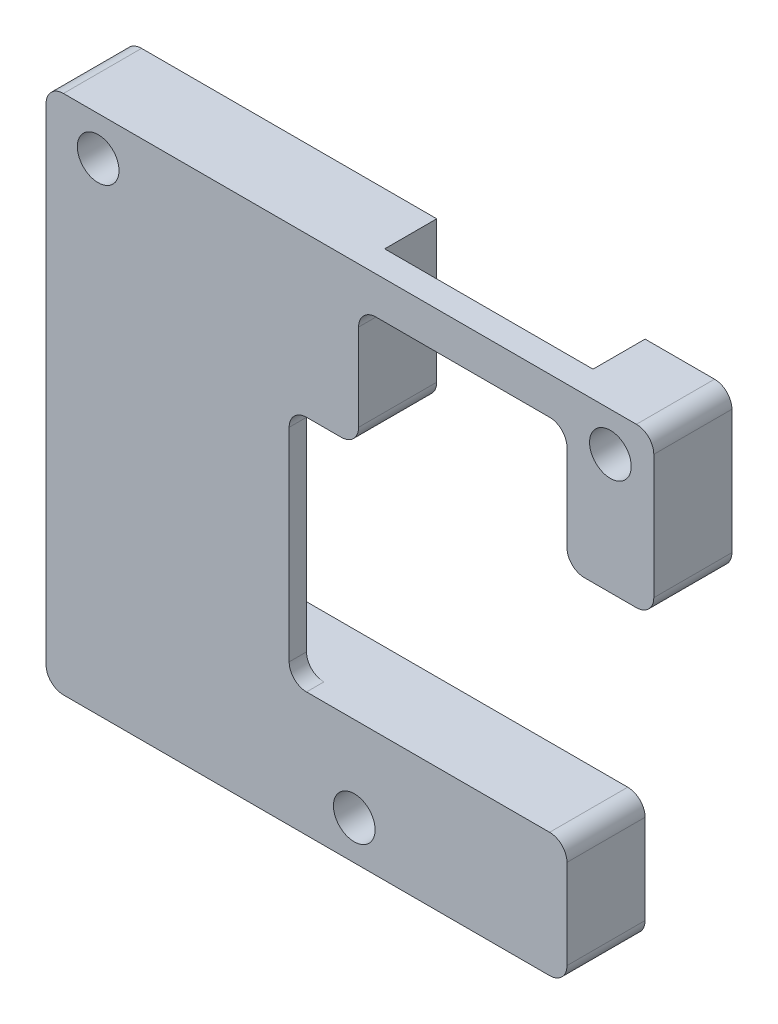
ISO-10303-21;
HEADER;
FILE_DESCRIPTION(('STEP AP214'),'2;1');
FILE_NAME('part.step','',(''),(''),'','','');
FILE_SCHEMA(('AUTOMOTIVE_DESIGN { 1 0 10303 214 1 1 1 1 }'));
ENDSEC;
DATA;
#1=APPLICATION_CONTEXT('core data for automotive mechanical design processes');
#2=APPLICATION_PROTOCOL_DEFINITION('international standard','automotive_design',2000,#1);
#3=PRODUCT_CONTEXT('',#1,'mechanical');
#4=PRODUCT('Part','Part','',(#3));
#5=PRODUCT_RELATED_PRODUCT_CATEGORY('part','',(#4));
#6=PRODUCT_DEFINITION_FORMATION('','',#4);
#7=PRODUCT_DEFINITION_CONTEXT('part definition',#1,'design');
#8=PRODUCT_DEFINITION('design','',#6,#7);
#9=PRODUCT_DEFINITION_SHAPE('','',#8);
#10=(LENGTH_UNIT() NAMED_UNIT(*) SI_UNIT(.MILLI.,.METRE.));
#11=(NAMED_UNIT(*) PLANE_ANGLE_UNIT() SI_UNIT($,.RADIAN.));
#12=(NAMED_UNIT(*) SI_UNIT($,.STERADIAN.) SOLID_ANGLE_UNIT());
#13=UNCERTAINTY_MEASURE_WITH_UNIT(LENGTH_MEASURE(1.E-05),#10,'distance_accuracy_value','');
#14=(GEOMETRIC_REPRESENTATION_CONTEXT(3) GLOBAL_UNCERTAINTY_ASSIGNED_CONTEXT((#13)) GLOBAL_UNIT_ASSIGNED_CONTEXT((#10,
#11,#12)) REPRESENTATION_CONTEXT('',''));
#15=CARTESIAN_POINT('',(0.,0.,0.));
#16=DIRECTION('',(0.,0.,1.));
#17=DIRECTION('',(1.,0.,0.));
#18=AXIS2_PLACEMENT_3D('',#15,#16,#17);
#19=CARTESIAN_POINT('',(0.,0.,0.));
#20=DIRECTION('',(0.,0.,1.));
#21=DIRECTION('',(1.,0.,0.));
#22=AXIS2_PLACEMENT_3D('',#19,#20,#21);
#23=PLANE('',#22);
#24=CARTESIAN_POINT('',(7.39999999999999,12.75,0.));
#25=DIRECTION('',(0.,0.,1.));
#26=DIRECTION('',(1.,0.,0.));
#27=AXIS2_PLACEMENT_3D('',#24,#25,#26);
#28=CIRCLE('',#27,1.2);
#29=CARTESIAN_POINT('',(8.59999999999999,12.75,0.));
#30=VERTEX_POINT('',#29);
#31=EDGE_CURVE('E390',#30,#30,#28,.T.);
#32=ORIENTED_EDGE('',*,*,#31,.T.);
#33=EDGE_LOOP('',(#32));
#34=FACE_BOUND('',#33,.T.);
#35=DIRECTION('',(0.,1.,0.));
#36=VECTOR('',#35,1.);
#37=CARTESIAN_POINT('',(22.4,12.85,0.));
#38=LINE('',#37,#36);
#39=CARTESIAN_POINT('',(22.4,6.85,0.));
#40=VERTEX_POINT('',#39);
#41=CARTESIAN_POINT('',(22.4,15.,0.));
#42=VERTEX_POINT('',#41);
#43=EDGE_CURVE('E221',#40,#42,#38,.T.);
#44=ORIENTED_EDGE('',*,*,#43,.F.);
#45=CARTESIAN_POINT('',(21.4,6.85,0.));
#46=DIRECTION('',(0.,0.,1.));
#47=DIRECTION('',(1.,0.,0.));
#48=AXIS2_PLACEMENT_3D('',#45,#46,#47);
#49=CIRCLE('',#48,1.);
#50=CARTESIAN_POINT('',(21.4,5.85,0.));
#51=VERTEX_POINT('',#50);
#52=EDGE_CURVE('E287',#40,#51,#49,.F.);
#53=ORIENTED_EDGE('',*,*,#52,.T.);
#54=DIRECTION('',(1.,0.,0.));
#55=VECTOR('',#54,1.);
#56=CARTESIAN_POINT('',(4.39999999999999,5.85,0.));
#57=LINE('',#56,#55);
#58=CARTESIAN_POINT('',(4.39999999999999,5.85,0.));
#59=VERTEX_POINT('',#58);
#60=EDGE_CURVE('E232',#59,#51,#57,.T.);
#61=ORIENTED_EDGE('',*,*,#60,.F.);
#62=DIRECTION('',(0.,-1.,0.));
#63=VECTOR('',#62,1.);
#64=CARTESIAN_POINT('',(4.39999999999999,15.,0.));
#65=LINE('',#64,#63);
#66=CARTESIAN_POINT('',(4.39999999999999,14.,0.));
#67=VERTEX_POINT('',#66);
#68=EDGE_CURVE('E432',#67,#59,#65,.T.);
#69=ORIENTED_EDGE('',*,*,#68,.F.);
#70=CARTESIAN_POINT('',(5.39999999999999,14.,0.));
#71=DIRECTION('',(0.,0.,1.));
#72=DIRECTION('',(1.,0.,0.));
#73=AXIS2_PLACEMENT_3D('',#70,#71,#72);
#74=CIRCLE('',#73,1.);
#75=CARTESIAN_POINT('',(5.39999999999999,15.,0.));
#76=VERTEX_POINT('',#75);
#77=EDGE_CURVE('E246',#67,#76,#74,.F.);
#78=ORIENTED_EDGE('',*,*,#77,.T.);
#79=DIRECTION('',(-1.,0.,0.));
#80=VECTOR('',#79,1.);
#81=CARTESIAN_POINT('',(4.39999999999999,15.,0.));
#82=LINE('',#81,#80);
#83=EDGE_CURVE('E237',#42,#76,#82,.T.);
#84=ORIENTED_EDGE('',*,*,#83,.F.);
#85=EDGE_LOOP('',(#44,#53,#61,#69,#78,#84));
#86=FACE_BOUND('',#85,.T.);
#87=ADVANCED_FACE('F34',(#34,#86),#23,.F.);
#88=CARTESIAN_POINT('',(18.4,15.,4.5));
#89=DIRECTION('',(-1.,0.,0.));
#90=DIRECTION('',(0.,-1.,0.));
#91=AXIS2_PLACEMENT_3D('',#88,#89,#90);
#92=PLANE('',#91);
#93=DIRECTION('',(0.,1.,0.));
#94=VECTOR('',#93,1.);
#95=CARTESIAN_POINT('',(18.4,15.,4.5));
#96=LINE('',#95,#94);
#97=CARTESIAN_POINT('',(18.4,-6.85,4.5));
#98=VERTEX_POINT('',#97);
#99=CARTESIAN_POINT('',(18.4,4.85,4.5));
#100=VERTEX_POINT('',#99);
#101=EDGE_CURVE('E384',#98,#100,#96,.T.);
#102=ORIENTED_EDGE('',*,*,#101,.F.);
#103=DIRECTION('',(0.,0.,-1.));
#104=VECTOR('',#103,1.);
#105=CARTESIAN_POINT('',(18.4,-6.85,3.5));
#106=LINE('',#105,#104);
#107=CARTESIAN_POINT('',(18.4,-6.85,3.5));
#108=VERTEX_POINT('',#107);
#109=EDGE_CURVE('E273',#98,#108,#106,.T.);
#110=ORIENTED_EDGE('',*,*,#109,.T.);
#111=DIRECTION('',(0.,1.,0.));
#112=VECTOR('',#111,1.);
#113=CARTESIAN_POINT('',(18.4,15.,3.5));
#114=LINE('',#113,#112);
#115=CARTESIAN_POINT('',(18.4,4.85,3.5));
#116=VERTEX_POINT('',#115);
#117=EDGE_CURVE('E363',#108,#116,#114,.T.);
#118=ORIENTED_EDGE('',*,*,#117,.T.);
#119=DIRECTION('',(0.,0.,-1.));
#120=VECTOR('',#119,1.);
#121=CARTESIAN_POINT('',(18.4,4.85,4.5));
#122=LINE('',#121,#120);
#123=EDGE_CURVE('E271',#116,#100,#122,.F.);
#124=ORIENTED_EDGE('',*,*,#123,.T.);
#125=EDGE_LOOP('',(#102,#110,#118,#124));
#126=FACE_BOUND('',#125,.T.);
#127=ADVANCED_FACE('F370',(#126),#92,.F.);
#128=CARTESIAN_POINT('',(0.,0.,3.5));
#129=DIRECTION('',(0.,0.,1.));
#130=DIRECTION('',(1.,0.,0.));
#131=AXIS2_PLACEMENT_3D('',#128,#129,#130);
#132=PLANE('',#131);
#133=DIRECTION('',(-1.,0.,0.));
#134=VECTOR('',#133,1.);
#135=CARTESIAN_POINT('',(4.4,-7.85,3.5));
#136=LINE('',#135,#134);
#137=CARTESIAN_POINT('',(19.4,-7.85,3.5));
#138=VERTEX_POINT('',#137);
#139=CARTESIAN_POINT('',(4.4,-7.85,3.5));
#140=VERTEX_POINT('',#139);
#141=EDGE_CURVE('E408',#138,#140,#136,.T.);
#142=ORIENTED_EDGE('',*,*,#141,.T.);
#143=DIRECTION('',(0.,-1.,0.));
#144=VECTOR('',#143,1.);
#145=CARTESIAN_POINT('',(4.39999999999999,15.,3.5));
#146=LINE('',#145,#144);
#147=CARTESIAN_POINT('',(4.39999999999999,5.85,3.5));
#148=VERTEX_POINT('',#147);
#149=EDGE_CURVE('E374',#148,#140,#146,.T.);
#150=ORIENTED_EDGE('',*,*,#149,.F.);
#151=DIRECTION('',(1.,0.,0.));
#152=VECTOR('',#151,1.);
#153=CARTESIAN_POINT('',(4.39999999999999,5.85,3.5));
#154=LINE('',#153,#152);
#155=CARTESIAN_POINT('',(19.4,5.85,3.5));
#156=VERTEX_POINT('',#155);
#157=EDGE_CURVE('E250',#148,#156,#154,.T.);
#158=ORIENTED_EDGE('',*,*,#157,.T.);
#159=CARTESIAN_POINT('',(19.4,4.85,3.5));
#160=DIRECTION('',(0.,0.,1.));
#161=DIRECTION('',(1.,0.,0.));
#162=AXIS2_PLACEMENT_3D('',#159,#160,#161);
#163=CIRCLE('',#162,1.);
#164=EDGE_CURVE('E42',#156,#116,#163,.T.);
#165=ORIENTED_EDGE('',*,*,#164,.T.);
#166=ORIENTED_EDGE('',*,*,#117,.F.);
#167=CARTESIAN_POINT('',(19.4,-6.85,3.5));
#168=DIRECTION('',(0.,0.,1.));
#169=DIRECTION('',(1.,0.,0.));
#170=AXIS2_PLACEMENT_3D('',#167,#168,#169);
#171=CIRCLE('',#170,1.);
#172=EDGE_CURVE('E353',#108,#138,#171,.T.);
#173=ORIENTED_EDGE('',*,*,#172,.T.);
#174=EDGE_LOOP('',(#142,#150,#158,#165,#166,#173));
#175=FACE_BOUND('',#174,.T.);
#176=ADVANCED_FACE('F362',(#175),#132,.F.);
#177=CARTESIAN_POINT('',(4.39999999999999,15.,3.5));
#178=DIRECTION('',(1.,0.,0.));
#179=DIRECTION('',(0.,1.,0.));
#180=AXIS2_PLACEMENT_3D('',#177,#178,#179);
#181=PLANE('',#180);
#182=DIRECTION('',(0.,-1.,0.));
#183=VECTOR('',#182,1.);
#184=CARTESIAN_POINT('',(4.39999999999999,15.,4.5));
#185=LINE('',#184,#183);
#186=CARTESIAN_POINT('',(4.39999999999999,14.,4.5));
#187=VERTEX_POINT('',#186);
#188=CARTESIAN_POINT('',(4.39999999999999,-14.,4.5));
#189=VERTEX_POINT('',#188);
#190=EDGE_CURVE('E373',#187,#189,#185,.T.);
#191=ORIENTED_EDGE('',*,*,#190,.F.);
#192=DIRECTION('',(0.,0.,-1.));
#193=VECTOR('',#192,1.);
#194=CARTESIAN_POINT('',(4.39999999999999,14.,3.5));
#195=LINE('',#194,#193);
#196=EDGE_CURVE('E307',#187,#67,#195,.T.);
#197=ORIENTED_EDGE('',*,*,#196,.T.);
#198=ORIENTED_EDGE('',*,*,#68,.T.);
#199=DIRECTION('',(0.,0.,-1.));
#200=VECTOR('',#199,1.);
#201=CARTESIAN_POINT('',(4.39999999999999,5.85,3.5));
#202=LINE('',#201,#200);
#203=EDGE_CURVE('E255',#148,#59,#202,.T.);
#204=ORIENTED_EDGE('',*,*,#203,.F.);
#205=ORIENTED_EDGE('',*,*,#149,.T.);
#206=DIRECTION('',(0.,0.,-1.));
#207=VECTOR('',#206,1.);
#208=CARTESIAN_POINT('',(4.4,-7.85,3.5));
#209=LINE('',#208,#207);
#210=CARTESIAN_POINT('',(4.4,-7.85,0.));
#211=VERTEX_POINT('',#210);
#212=EDGE_CURVE('E410',#140,#211,#209,.T.);
#213=ORIENTED_EDGE('',*,*,#212,.T.);
#214=DIRECTION('',(0.,-1.,0.));
#215=VECTOR('',#214,1.);
#216=CARTESIAN_POINT('',(4.39999999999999,-15.,0.));
#217=LINE('',#216,#215);
#218=CARTESIAN_POINT('',(4.39999999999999,-14.,0.));
#219=VERTEX_POINT('',#218);
#220=EDGE_CURVE('E403',#211,#219,#217,.T.);
#221=ORIENTED_EDGE('',*,*,#220,.T.);
#222=DIRECTION('',(0.,0.,-1.));
#223=VECTOR('',#222,1.);
#224=CARTESIAN_POINT('',(4.4,-14.,3.5));
#225=LINE('',#224,#223);
#226=EDGE_CURVE('E305',#219,#189,#225,.F.);
#227=ORIENTED_EDGE('',*,*,#226,.T.);
#228=EDGE_LOOP('',(#191,#197,#198,#204,#205,#213,#221,#227));
#229=FACE_BOUND('',#228,.T.);
#230=ADVANCED_FACE('F554',(#229),#181,.F.);
#231=CARTESIAN_POINT('',(4.39999999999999,5.85,3.5));
#232=DIRECTION('',(0.,1.,0.));
#233=DIRECTION('',(0.,0.,1.));
#234=AXIS2_PLACEMENT_3D('',#231,#232,#233);
#235=PLANE('',#234);
#236=DIRECTION('',(1.,0.,0.));
#237=VECTOR('',#236,1.);
#238=CARTESIAN_POINT('',(18.4,5.85,4.5));
#239=LINE('',#238,#237);
#240=CARTESIAN_POINT('',(19.4,5.85,4.5));
#241=VERTEX_POINT('',#240);
#242=CARTESIAN_POINT('',(21.4,5.85,4.5));
#243=VERTEX_POINT('',#242);
#244=EDGE_CURVE('E382',#241,#243,#239,.T.);
#245=ORIENTED_EDGE('',*,*,#244,.F.);
#246=DIRECTION('',(0.,0.,-1.));
#247=VECTOR('',#246,1.);
#248=CARTESIAN_POINT('',(19.4,5.85,3.5));
#249=LINE('',#248,#247);
#250=EDGE_CURVE('E283',#241,#156,#249,.T.);
#251=ORIENTED_EDGE('',*,*,#250,.T.);
#252=ORIENTED_EDGE('',*,*,#157,.F.);
#253=ORIENTED_EDGE('',*,*,#203,.T.);
#254=ORIENTED_EDGE('',*,*,#60,.T.);
#255=DIRECTION('',(0.,0.,-1.));
#256=VECTOR('',#255,1.);
#257=CARTESIAN_POINT('',(21.4,5.85,3.5));
#258=LINE('',#257,#256);
#259=EDGE_CURVE('E281',#51,#243,#258,.F.);
#260=ORIENTED_EDGE('',*,*,#259,.T.);
#261=EDGE_LOOP('',(#245,#251,#252,#253,#254,#260));
#262=FACE_BOUND('',#261,.T.);
#263=ADVANCED_FACE('F386',(#262),#235,.F.);
#264=CARTESIAN_POINT('',(22.4,12.85,3.5));
#265=DIRECTION('',(-1.,0.,0.));
#266=DIRECTION('',(0.,-1.,0.));
#267=AXIS2_PLACEMENT_3D('',#264,#265,#266);
#268=PLANE('',#267);
#269=DIRECTION('',(0.,-1.,0.));
#270=VECTOR('',#269,1.);
#271=CARTESIAN_POINT('',(22.4,15.,3.));
#272=LINE('',#271,#270);
#273=CARTESIAN_POINT('',(22.4,15.,3.));
#274=VERTEX_POINT('',#273);
#275=CARTESIAN_POINT('',(22.4,11.85,3.));
#276=VERTEX_POINT('',#275);
#277=EDGE_CURVE('E490',#274,#276,#272,.T.);
#278=ORIENTED_EDGE('',*,*,#277,.T.);
#279=DIRECTION('',(0.,0.,-1.));
#280=VECTOR('',#279,1.);
#281=CARTESIAN_POINT('',(22.4,11.85,4.5));
#282=LINE('',#281,#280);
#283=CARTESIAN_POINT('',(22.4,11.85,4.5));
#284=VERTEX_POINT('',#283);
#285=EDGE_CURVE('E269',#276,#284,#282,.F.);
#286=ORIENTED_EDGE('',*,*,#285,.T.);
#287=DIRECTION('',(0.,1.,0.));
#288=VECTOR('',#287,1.);
#289=CARTESIAN_POINT('',(22.4,5.85,4.5));
#290=LINE('',#289,#288);
#291=CARTESIAN_POINT('',(22.4,6.85,4.5));
#292=VERTEX_POINT('',#291);
#293=EDGE_CURVE('E389',#292,#284,#290,.T.);
#294=ORIENTED_EDGE('',*,*,#293,.F.);
#295=DIRECTION('',(0.,0.,-1.));
#296=VECTOR('',#295,1.);
#297=CARTESIAN_POINT('',(22.4,6.85,3.5));
#298=LINE('',#297,#296);
#299=EDGE_CURVE('E228',#292,#40,#298,.T.);
#300=ORIENTED_EDGE('',*,*,#299,.T.);
#301=ORIENTED_EDGE('',*,*,#43,.T.);
#302=DIRECTION('',(0.,0.,-1.));
#303=VECTOR('',#302,1.);
#304=CARTESIAN_POINT('',(22.4,15.,0.));
#305=LINE('',#304,#303);
#306=EDGE_CURVE('E224',#274,#42,#305,.T.);
#307=ORIENTED_EDGE('',*,*,#306,.F.);
#308=EDGE_LOOP('',(#278,#286,#294,#300,#301,#307));
#309=FACE_BOUND('',#308,.T.);
#310=ADVANCED_FACE('F223',(#309),#268,.F.);
#311=CARTESIAN_POINT('',(22.4,12.85,3.5));
#312=DIRECTION('',(0.,1.,0.));
#313=DIRECTION('',(0.,0.,1.));
#314=AXIS2_PLACEMENT_3D('',#311,#312,#313);
#315=PLANE('',#314);
#316=DIRECTION('',(-1.,0.,0.));
#317=VECTOR('',#316,1.);
#318=CARTESIAN_POINT('',(22.4,12.85,3.));
#319=LINE('',#318,#317);
#320=CARTESIAN_POINT('',(33.4,12.85,3.));
#321=VERTEX_POINT('',#320);
#322=CARTESIAN_POINT('',(23.4,12.85,3.));
#323=VERTEX_POINT('',#322);
#324=EDGE_CURVE('E243',#321,#323,#319,.T.);
#325=ORIENTED_EDGE('',*,*,#324,.F.);
#326=DIRECTION('',(0.,0.,-1.));
#327=VECTOR('',#326,1.);
#328=CARTESIAN_POINT('',(33.4,12.85,4.5));
#329=LINE('',#328,#327);
#330=CARTESIAN_POINT('',(33.4,12.85,4.5));
#331=VERTEX_POINT('',#330);
#332=EDGE_CURVE('E266',#321,#331,#329,.F.);
#333=ORIENTED_EDGE('',*,*,#332,.T.);
#334=DIRECTION('',(1.,0.,0.));
#335=VECTOR('',#334,1.);
#336=CARTESIAN_POINT('',(22.4,12.85,4.5));
#337=LINE('',#336,#335);
#338=CARTESIAN_POINT('',(23.4,12.85,4.5));
#339=VERTEX_POINT('',#338);
#340=EDGE_CURVE('E393',#339,#331,#337,.T.);
#341=ORIENTED_EDGE('',*,*,#340,.F.);
#342=DIRECTION('',(0.,0.,-1.));
#343=VECTOR('',#342,1.);
#344=CARTESIAN_POINT('',(23.4,12.85,3.));
#345=LINE('',#344,#343);
#346=EDGE_CURVE('E263',#339,#323,#345,.T.);
#347=ORIENTED_EDGE('',*,*,#346,.T.);
#348=EDGE_LOOP('',(#325,#333,#341,#347));
#349=FACE_BOUND('',#348,.T.);
#350=ADVANCED_FACE('F547',(#349),#315,.F.);
#351=CARTESIAN_POINT('',(34.4,12.85,3.5));
#352=DIRECTION('',(1.,0.,0.));
#353=DIRECTION('',(0.,0.,-1.));
#354=AXIS2_PLACEMENT_3D('',#351,#352,#353);
#355=PLANE('',#354);
#356=DIRECTION('',(0.,-1.,0.));
#357=VECTOR('',#356,1.);
#358=CARTESIAN_POINT('',(34.4,12.85,4.5));
#359=LINE('',#358,#357);
#360=CARTESIAN_POINT('',(34.4,11.85,4.5));
#361=VERTEX_POINT('',#360);
#362=CARTESIAN_POINT('',(34.4,6.85,4.5));
#363=VERTEX_POINT('',#362);
#364=EDGE_CURVE('E456',#361,#363,#359,.T.);
#365=ORIENTED_EDGE('',*,*,#364,.F.);
#366=DIRECTION('',(0.,0.,-1.));
#367=VECTOR('',#366,1.);
#368=CARTESIAN_POINT('',(34.4,11.85,3.));
#369=LINE('',#368,#367);
#370=CARTESIAN_POINT('',(34.4,11.85,3.));
#371=VERTEX_POINT('',#370);
#372=EDGE_CURVE('E260',#361,#371,#369,.T.);
#373=ORIENTED_EDGE('',*,*,#372,.T.);
#374=DIRECTION('',(0.,-1.,0.));
#375=VECTOR('',#374,1.);
#376=CARTESIAN_POINT('',(34.4,15.,3.));
#377=LINE('',#376,#375);
#378=CARTESIAN_POINT('',(34.4,15.,3.));
#379=VERTEX_POINT('',#378);
#380=EDGE_CURVE('E478',#379,#371,#377,.T.);
#381=ORIENTED_EDGE('',*,*,#380,.F.);
#382=DIRECTION('',(0.,0.,1.));
#383=VECTOR('',#382,1.);
#384=CARTESIAN_POINT('',(34.4,15.,0.));
#385=LINE('',#384,#383);
#386=CARTESIAN_POINT('',(34.4,15.,0.));
#387=VERTEX_POINT('',#386);
#388=EDGE_CURVE('E242',#387,#379,#385,.T.);
#389=ORIENTED_EDGE('',*,*,#388,.F.);
#390=DIRECTION('',(0.,-1.,0.));
#391=VECTOR('',#390,1.);
#392=CARTESIAN_POINT('',(34.4,12.85,0.));
#393=LINE('',#392,#391);
#394=CARTESIAN_POINT('',(34.4,6.85,0.));
#395=VERTEX_POINT('',#394);
#396=EDGE_CURVE('E231',#387,#395,#393,.T.);
#397=ORIENTED_EDGE('',*,*,#396,.T.);
#398=DIRECTION('',(0.,0.,-1.));
#399=VECTOR('',#398,1.);
#400=CARTESIAN_POINT('',(34.4,6.85,3.5));
#401=LINE('',#400,#399);
#402=EDGE_CURVE('E258',#395,#363,#401,.F.);
#403=ORIENTED_EDGE('',*,*,#402,.T.);
#404=EDGE_LOOP('',(#365,#373,#381,#389,#397,#403));
#405=FACE_BOUND('',#404,.T.);
#406=ADVANCED_FACE('F476',(#405),#355,.F.);
#407=CARTESIAN_POINT('',(34.4,5.85,3.5));
#408=DIRECTION('',(0.,1.,0.));
#409=DIRECTION('',(0.,0.,1.));
#410=AXIS2_PLACEMENT_3D('',#407,#408,#409);
#411=PLANE('',#410);
#412=DIRECTION('',(1.,0.,0.));
#413=VECTOR('',#412,1.);
#414=CARTESIAN_POINT('',(34.4,5.85,4.5));
#415=LINE('',#414,#413);
#416=CARTESIAN_POINT('',(35.4,5.85,4.5));
#417=VERTEX_POINT('',#416);
#418=CARTESIAN_POINT('',(38.4,5.85,4.5));
#419=VERTEX_POINT('',#418);
#420=EDGE_CURVE('E451',#417,#419,#415,.T.);
#421=ORIENTED_EDGE('',*,*,#420,.F.);
#422=DIRECTION('',(0.,0.,-1.));
#423=VECTOR('',#422,1.);
#424=CARTESIAN_POINT('',(35.4,5.85,3.5));
#425=LINE('',#424,#423);
#426=CARTESIAN_POINT('',(35.4,5.85,0.));
#427=VERTEX_POINT('',#426);
#428=EDGE_CURVE('E333',#417,#427,#425,.T.);
#429=ORIENTED_EDGE('',*,*,#428,.T.);
#430=DIRECTION('',(1.,0.,0.));
#431=VECTOR('',#430,1.);
#432=CARTESIAN_POINT('',(34.4,5.85,0.));
#433=LINE('',#432,#431);
#434=CARTESIAN_POINT('',(38.4,5.85,0.));
#435=VERTEX_POINT('',#434);
#436=EDGE_CURVE('E251',#427,#435,#433,.T.);
#437=ORIENTED_EDGE('',*,*,#436,.T.);
#438=DIRECTION('',(0.,0.,-1.));
#439=VECTOR('',#438,1.);
#440=CARTESIAN_POINT('',(38.4,5.85,3.5));
#441=LINE('',#440,#439);
#442=EDGE_CURVE('E331',#435,#419,#441,.F.);
#443=ORIENTED_EDGE('',*,*,#442,.T.);
#444=EDGE_LOOP('',(#421,#429,#437,#443));
#445=FACE_BOUND('',#444,.T.);
#446=ADVANCED_FACE('F443',(#445),#411,.F.);
#447=CARTESIAN_POINT('',(39.4,15.,3.5));
#448=DIRECTION('',(-1.,0.,0.));
#449=DIRECTION('',(0.,0.,1.));
#450=AXIS2_PLACEMENT_3D('',#447,#448,#449);
#451=PLANE('',#450);
#452=DIRECTION('',(0.,1.,0.));
#453=VECTOR('',#452,1.);
#454=CARTESIAN_POINT('',(39.4,5.85,4.5));
#455=LINE('',#454,#453);
#456=CARTESIAN_POINT('',(39.4,6.85,4.5));
#457=VERTEX_POINT('',#456);
#458=CARTESIAN_POINT('',(39.4,14.,4.5));
#459=VERTEX_POINT('',#458);
#460=EDGE_CURVE('E407',#457,#459,#455,.T.);
#461=ORIENTED_EDGE('',*,*,#460,.F.);
#462=DIRECTION('',(0.,0.,-1.));
#463=VECTOR('',#462,1.);
#464=CARTESIAN_POINT('',(39.4,6.85,3.5));
#465=LINE('',#464,#463);
#466=CARTESIAN_POINT('',(39.4,6.85,0.));
#467=VERTEX_POINT('',#466);
#468=EDGE_CURVE('E342',#457,#467,#465,.T.);
#469=ORIENTED_EDGE('',*,*,#468,.T.);
#470=DIRECTION('',(0.,1.,0.));
#471=VECTOR('',#470,1.);
#472=CARTESIAN_POINT('',(39.4,15.,0.));
#473=LINE('',#472,#471);
#474=CARTESIAN_POINT('',(39.4,14.,0.));
#475=VERTEX_POINT('',#474);
#476=EDGE_CURVE('E248',#467,#475,#473,.T.);
#477=ORIENTED_EDGE('',*,*,#476,.T.);
#478=DIRECTION('',(0.,0.,-1.));
#479=VECTOR('',#478,1.);
#480=CARTESIAN_POINT('',(39.4,14.,3.5));
#481=LINE('',#480,#479);
#482=EDGE_CURVE('E340',#475,#459,#481,.F.);
#483=ORIENTED_EDGE('',*,*,#482,.T.);
#484=EDGE_LOOP('',(#461,#469,#477,#483));
#485=FACE_BOUND('',#484,.T.);
#486=ADVANCED_FACE('F453',(#485),#451,.F.);
#487=CARTESIAN_POINT('',(4.39999999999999,15.,3.5));
#488=DIRECTION('',(0.,-1.,0.));
#489=DIRECTION('',(0.,0.,-1.));
#490=AXIS2_PLACEMENT_3D('',#487,#488,#489);
#491=PLANE('',#490);
#492=ORIENTED_EDGE('',*,*,#83,.T.);
#493=DIRECTION('',(0.,0.,-1.));
#494=VECTOR('',#493,1.);
#495=CARTESIAN_POINT('',(5.39999999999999,15.,3.5));
#496=LINE('',#495,#494);
#497=CARTESIAN_POINT('',(5.39999999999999,15.,4.5));
#498=VERTEX_POINT('',#497);
#499=EDGE_CURVE('E313',#76,#498,#496,.F.);
#500=ORIENTED_EDGE('',*,*,#499,.T.);
#501=DIRECTION('',(-1.,0.,0.));
#502=VECTOR('',#501,1.);
#503=CARTESIAN_POINT('',(4.39999999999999,15.,4.5));
#504=LINE('',#503,#502);
#505=CARTESIAN_POINT('',(38.4,15.,4.5));
#506=VERTEX_POINT('',#505);
#507=EDGE_CURVE('E429',#506,#498,#504,.T.);
#508=ORIENTED_EDGE('',*,*,#507,.F.);
#509=DIRECTION('',(0.,0.,-1.));
#510=VECTOR('',#509,1.);
#511=CARTESIAN_POINT('',(38.4,15.,3.5));
#512=LINE('',#511,#510);
#513=CARTESIAN_POINT('',(38.4,15.,0.));
#514=VERTEX_POINT('',#513);
#515=EDGE_CURVE('E310',#506,#514,#512,.T.);
#516=ORIENTED_EDGE('',*,*,#515,.T.);
#517=EDGE_CURVE('E247',#514,#387,#82,.T.);
#518=ORIENTED_EDGE('',*,*,#517,.T.);
#519=ORIENTED_EDGE('',*,*,#388,.T.);
#520=DIRECTION('',(-1.,0.,0.));
#521=VECTOR('',#520,1.);
#522=CARTESIAN_POINT('',(22.4,15.,3.));
#523=LINE('',#522,#521);
#524=EDGE_CURVE('E241',#379,#274,#523,.T.);
#525=ORIENTED_EDGE('',*,*,#524,.T.);
#526=ORIENTED_EDGE('',*,*,#306,.T.);
#527=EDGE_LOOP('',(#492,#500,#508,#516,#518,#519,#525,#526));
#528=FACE_BOUND('',#527,.T.);
#529=ADVANCED_FACE('F236',(#528),#491,.F.);
#530=CARTESIAN_POINT('',(36.9,12.75,0.));
#531=DIRECTION('',(0.,0.,1.));
#532=DIRECTION('',(1.,0.,0.));
#533=AXIS2_PLACEMENT_3D('',#530,#531,#532);
#534=CIRCLE('',#533,1.2);
#535=CARTESIAN_POINT('',(38.1,12.75,0.));
#536=VERTEX_POINT('',#535);
#537=EDGE_CURVE('E500',#536,#536,#534,.T.);
#538=ORIENTED_EDGE('',*,*,#537,.T.);
#539=EDGE_LOOP('',(#538));
#540=FACE_BOUND('',#539,.T.);
#541=ORIENTED_EDGE('',*,*,#436,.F.);
#542=CARTESIAN_POINT('',(35.4,6.85,0.));
#543=DIRECTION('',(0.,0.,1.));
#544=DIRECTION('',(1.,0.,0.));
#545=AXIS2_PLACEMENT_3D('',#542,#543,#544);
#546=CIRCLE('',#545,1.);
#547=EDGE_CURVE('E338',#427,#395,#546,.F.);
#548=ORIENTED_EDGE('',*,*,#547,.T.);
#549=ORIENTED_EDGE('',*,*,#396,.F.);
#550=ORIENTED_EDGE('',*,*,#517,.F.);
#551=CARTESIAN_POINT('',(38.4,14.,0.));
#552=DIRECTION('',(0.,0.,1.));
#553=DIRECTION('',(1.,0.,0.));
#554=AXIS2_PLACEMENT_3D('',#551,#552,#553);
#555=CIRCLE('',#554,1.);
#556=EDGE_CURVE('E49',#514,#475,#555,.F.);
#557=ORIENTED_EDGE('',*,*,#556,.T.);
#558=ORIENTED_EDGE('',*,*,#476,.F.);
#559=CARTESIAN_POINT('',(38.4,6.85,0.));
#560=DIRECTION('',(0.,0.,1.));
#561=DIRECTION('',(1.,0.,0.));
#562=AXIS2_PLACEMENT_3D('',#559,#560,#561);
#563=CIRCLE('',#562,1.);
#564=EDGE_CURVE('E57',#467,#435,#563,.F.);
#565=ORIENTED_EDGE('',*,*,#564,.T.);
#566=EDGE_LOOP('',(#541,#548,#549,#550,#557,#558,#565));
#567=FACE_BOUND('',#566,.T.);
#568=ADVANCED_FACE('F484',(#540,#567),#23,.F.);
#569=CARTESIAN_POINT('',(4.39999999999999,-15.,4.5));
#570=DIRECTION('',(0.,1.,0.));
#571=DIRECTION('',(0.,0.,1.));
#572=AXIS2_PLACEMENT_3D('',#569,#570,#571);
#573=PLANE('',#572);
#574=DIRECTION('',(1.,0.,0.));
#575=VECTOR('',#574,1.);
#576=CARTESIAN_POINT('',(4.39999999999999,-15.,4.5));
#577=LINE('',#576,#575);
#578=CARTESIAN_POINT('',(5.4,-15.,4.5));
#579=VERTEX_POINT('',#578);
#580=CARTESIAN_POINT('',(33.4,-15.,4.5));
#581=VERTEX_POINT('',#580);
#582=EDGE_CURVE('E425',#579,#581,#577,.T.);
#583=ORIENTED_EDGE('',*,*,#582,.F.);
#584=DIRECTION('',(0.,0.,-1.));
#585=VECTOR('',#584,1.);
#586=CARTESIAN_POINT('',(5.4,-15.,4.5));
#587=LINE('',#586,#585);
#588=CARTESIAN_POINT('',(5.4,-15.,0.));
#589=VERTEX_POINT('',#588);
#590=EDGE_CURVE('E317',#579,#589,#587,.T.);
#591=ORIENTED_EDGE('',*,*,#590,.T.);
#592=DIRECTION('',(1.,0.,0.));
#593=VECTOR('',#592,1.);
#594=CARTESIAN_POINT('',(4.39999999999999,-15.,0.));
#595=LINE('',#594,#593);
#596=CARTESIAN_POINT('',(33.4,-15.,0.));
#597=VERTEX_POINT('',#596);
#598=EDGE_CURVE('E414',#589,#597,#595,.T.);
#599=ORIENTED_EDGE('',*,*,#598,.T.);
#600=DIRECTION('',(0.,0.,-1.));
#601=VECTOR('',#600,1.);
#602=CARTESIAN_POINT('',(33.4,-15.,4.5));
#603=LINE('',#602,#601);
#604=EDGE_CURVE('E315',#597,#581,#603,.F.);
#605=ORIENTED_EDGE('',*,*,#604,.T.);
#606=EDGE_LOOP('',(#583,#591,#599,#605));
#607=FACE_BOUND('',#606,.T.);
#608=ADVANCED_FACE('F511',(#607),#573,.F.);
#609=CARTESIAN_POINT('',(0.,0.,4.5));
#610=DIRECTION('',(0.,0.,1.));
#611=DIRECTION('',(1.,0.,0.));
#612=AXIS2_PLACEMENT_3D('',#609,#610,#611);
#613=PLANE('',#612);
#614=CARTESIAN_POINT('',(7.39999999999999,12.75,4.5));
#615=DIRECTION('',(0.,0.,1.));
#616=DIRECTION('',(1.,0.,0.));
#617=AXIS2_PLACEMENT_3D('',#614,#615,#616);
#618=CIRCLE('',#617,1.2);
#619=CARTESIAN_POINT('',(8.59999999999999,12.75,4.5));
#620=VERTEX_POINT('',#619);
#621=EDGE_CURVE('E396',#620,#620,#618,.T.);
#622=ORIENTED_EDGE('',*,*,#621,.F.);
#623=EDGE_LOOP('',(#622));
#624=FACE_BOUND('',#623,.T.);
#625=CARTESIAN_POINT('',(22.15,-12.75,4.5));
#626=DIRECTION('',(0.,0.,1.));
#627=DIRECTION('',(1.,0.,0.));
#628=AXIS2_PLACEMENT_3D('',#625,#626,#627);
#629=CIRCLE('',#628,1.2);
#630=CARTESIAN_POINT('',(23.35,-12.75,4.5));
#631=VERTEX_POINT('',#630);
#632=EDGE_CURVE('E498',#631,#631,#629,.T.);
#633=ORIENTED_EDGE('',*,*,#632,.F.);
#634=EDGE_LOOP('',(#633));
#635=FACE_BOUND('',#634,.T.);
#636=CARTESIAN_POINT('',(36.9,12.75,4.5));
#637=DIRECTION('',(0.,0.,1.));
#638=DIRECTION('',(1.,0.,0.));
#639=AXIS2_PLACEMENT_3D('',#636,#637,#638);
#640=CIRCLE('',#639,1.2);
#641=CARTESIAN_POINT('',(38.1,12.75,4.5));
#642=VERTEX_POINT('',#641);
#643=EDGE_CURVE('E459',#642,#642,#640,.T.);
#644=ORIENTED_EDGE('',*,*,#643,.F.);
#645=EDGE_LOOP('',(#644));
#646=FACE_BOUND('',#645,.T.);
#647=ORIENTED_EDGE('',*,*,#244,.T.);
#648=CARTESIAN_POINT('',(21.4,6.85,4.5));
#649=DIRECTION('',(0.,0.,1.));
#650=DIRECTION('',(1.,0.,0.));
#651=AXIS2_PLACEMENT_3D('',#648,#649,#650);
#652=CIRCLE('',#651,1.);
#653=EDGE_CURVE('E303',#243,#292,#652,.T.);
#654=ORIENTED_EDGE('',*,*,#653,.T.);
#655=ORIENTED_EDGE('',*,*,#293,.T.);
#656=CARTESIAN_POINT('',(23.4,11.85,4.5));
#657=DIRECTION('',(0.,0.,1.));
#658=DIRECTION('',(1.,0.,0.));
#659=AXIS2_PLACEMENT_3D('',#656,#657,#658);
#660=CIRCLE('',#659,1.);
#661=EDGE_CURVE('E351',#284,#339,#660,.F.);
#662=ORIENTED_EDGE('',*,*,#661,.T.);
#663=ORIENTED_EDGE('',*,*,#340,.T.);
#664=CARTESIAN_POINT('',(33.4,11.85,4.5));
#665=DIRECTION('',(0.,0.,1.));
#666=DIRECTION('',(1.,0.,0.));
#667=AXIS2_PLACEMENT_3D('',#664,#665,#666);
#668=CIRCLE('',#667,1.);
#669=EDGE_CURVE('E346',#331,#361,#668,.F.);
#670=ORIENTED_EDGE('',*,*,#669,.T.);
#671=ORIENTED_EDGE('',*,*,#364,.T.);
#672=CARTESIAN_POINT('',(35.4,6.85,4.5));
#673=DIRECTION('',(0.,0.,1.));
#674=DIRECTION('',(1.,0.,0.));
#675=AXIS2_PLACEMENT_3D('',#672,#673,#674);
#676=CIRCLE('',#675,1.);
#677=EDGE_CURVE('E293',#363,#417,#676,.T.);
#678=ORIENTED_EDGE('',*,*,#677,.T.);
#679=ORIENTED_EDGE('',*,*,#420,.T.);
#680=CARTESIAN_POINT('',(38.4,6.85,4.5));
#681=DIRECTION('',(0.,0.,1.));
#682=DIRECTION('',(1.,0.,0.));
#683=AXIS2_PLACEMENT_3D('',#680,#681,#682);
#684=CIRCLE('',#683,1.);
#685=EDGE_CURVE('E291',#419,#457,#684,.T.);
#686=ORIENTED_EDGE('',*,*,#685,.T.);
#687=ORIENTED_EDGE('',*,*,#460,.T.);
#688=CARTESIAN_POINT('',(38.4,14.,4.5));
#689=DIRECTION('',(0.,0.,1.));
#690=DIRECTION('',(1.,0.,0.));
#691=AXIS2_PLACEMENT_3D('',#688,#689,#690);
#692=CIRCLE('',#691,1.);
#693=EDGE_CURVE('E289',#459,#506,#692,.T.);
#694=ORIENTED_EDGE('',*,*,#693,.T.);
#695=ORIENTED_EDGE('',*,*,#507,.T.);
#696=CARTESIAN_POINT('',(5.39999999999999,14.,4.5));
#697=DIRECTION('',(0.,0.,1.));
#698=DIRECTION('',(1.,0.,0.));
#699=AXIS2_PLACEMENT_3D('',#696,#697,#698);
#700=CIRCLE('',#699,1.);
#701=EDGE_CURVE('E301',#498,#187,#700,.T.);
#702=ORIENTED_EDGE('',*,*,#701,.T.);
#703=ORIENTED_EDGE('',*,*,#190,.T.);
#704=CARTESIAN_POINT('',(5.4,-14.,4.5));
#705=DIRECTION('',(0.,0.,1.));
#706=DIRECTION('',(1.,0.,0.));
#707=AXIS2_PLACEMENT_3D('',#704,#705,#706);
#708=CIRCLE('',#707,1.);
#709=EDGE_CURVE('E299',#189,#579,#708,.T.);
#710=ORIENTED_EDGE('',*,*,#709,.T.);
#711=ORIENTED_EDGE('',*,*,#582,.T.);
#712=CARTESIAN_POINT('',(33.4,-14.,4.5));
#713=DIRECTION('',(0.,0.,1.));
#714=DIRECTION('',(1.,0.,0.));
#715=AXIS2_PLACEMENT_3D('',#712,#713,#714);
#716=CIRCLE('',#715,1.);
#717=CARTESIAN_POINT('',(34.4,-14.,4.5));
#718=VERTEX_POINT('',#717);
#719=EDGE_CURVE('E295',#581,#718,#716,.T.);
#720=ORIENTED_EDGE('',*,*,#719,.T.);
#721=DIRECTION('',(0.,1.,0.));
#722=VECTOR('',#721,1.);
#723=CARTESIAN_POINT('',(34.4,-15.,4.5));
#724=LINE('',#723,#722);
#725=CARTESIAN_POINT('',(34.4,-8.85,4.5));
#726=VERTEX_POINT('',#725);
#727=EDGE_CURVE('E404',#718,#726,#724,.T.);
#728=ORIENTED_EDGE('',*,*,#727,.T.);
#729=CARTESIAN_POINT('',(33.4,-8.85,4.5));
#730=DIRECTION('',(0.,0.,1.));
#731=DIRECTION('',(1.,0.,0.));
#732=AXIS2_PLACEMENT_3D('',#729,#730,#731);
#733=CIRCLE('',#732,1.);
#734=CARTESIAN_POINT('',(33.4,-7.85,4.5));
#735=VERTEX_POINT('',#734);
#736=EDGE_CURVE('E297',#726,#735,#733,.T.);
#737=ORIENTED_EDGE('',*,*,#736,.T.);
#738=DIRECTION('',(-1.,0.,0.));
#739=VECTOR('',#738,1.);
#740=CARTESIAN_POINT('',(34.4,-7.85,4.5));
#741=LINE('',#740,#739);
#742=CARTESIAN_POINT('',(19.4,-7.85,4.5));
#743=VERTEX_POINT('',#742);
#744=EDGE_CURVE('E400',#735,#743,#741,.T.);
#745=ORIENTED_EDGE('',*,*,#744,.T.);
#746=CARTESIAN_POINT('',(19.4,-6.85,4.5));
#747=DIRECTION('',(0.,0.,1.));
#748=DIRECTION('',(1.,0.,0.));
#749=AXIS2_PLACEMENT_3D('',#746,#747,#748);
#750=CIRCLE('',#749,1.);
#751=EDGE_CURVE('E356',#743,#98,#750,.F.);
#752=ORIENTED_EDGE('',*,*,#751,.T.);
#753=ORIENTED_EDGE('',*,*,#101,.T.);
#754=CARTESIAN_POINT('',(19.4,4.85,4.5));
#755=DIRECTION('',(0.,0.,1.));
#756=DIRECTION('',(1.,0.,0.));
#757=AXIS2_PLACEMENT_3D('',#754,#755,#756);
#758=CIRCLE('',#757,1.);
#759=EDGE_CURVE('E11',#100,#241,#758,.F.);
#760=ORIENTED_EDGE('',*,*,#759,.T.);
#761=EDGE_LOOP('',(#647,#654,#655,#662,#663,#670,#671,#678,#679,#686,#687,#694,#695,#702,#703,
#710,#711,#720,#728,#737,#745,#752,#753,#760));
#762=FACE_BOUND('',#761,.T.);
#763=ADVANCED_FACE('F381',(#624,#635,#646,#762),#613,.T.);
#764=CARTESIAN_POINT('',(34.4,-15.,3.5));
#765=DIRECTION('',(-1.,0.,0.));
#766=DIRECTION('',(0.,0.,1.));
#767=AXIS2_PLACEMENT_3D('',#764,#765,#766);
#768=PLANE('',#767);
#769=DIRECTION('',(0.,1.,0.));
#770=VECTOR('',#769,1.);
#771=CARTESIAN_POINT('',(34.4,-15.,0.));
#772=LINE('',#771,#770);
#773=CARTESIAN_POINT('',(34.4,-14.,0.));
#774=VERTEX_POINT('',#773);
#775=CARTESIAN_POINT('',(34.4,-8.85,0.));
#776=VERTEX_POINT('',#775);
#777=EDGE_CURVE('E417',#774,#776,#772,.T.);
#778=ORIENTED_EDGE('',*,*,#777,.T.);
#779=DIRECTION('',(0.,0.,-1.));
#780=VECTOR('',#779,1.);
#781=CARTESIAN_POINT('',(34.4,-8.85,3.5));
#782=LINE('',#781,#780);
#783=EDGE_CURVE('E329',#776,#726,#782,.F.);
#784=ORIENTED_EDGE('',*,*,#783,.T.);
#785=ORIENTED_EDGE('',*,*,#727,.F.);
#786=DIRECTION('',(0.,0.,-1.));
#787=VECTOR('',#786,1.);
#788=CARTESIAN_POINT('',(34.4,-14.,3.5));
#789=LINE('',#788,#787);
#790=EDGE_CURVE('E326',#718,#774,#789,.T.);
#791=ORIENTED_EDGE('',*,*,#790,.T.);
#792=EDGE_LOOP('',(#778,#784,#785,#791));
#793=FACE_BOUND('',#792,.T.);
#794=ADVANCED_FACE('F510',(#793),#768,.F.);
#795=CARTESIAN_POINT('',(4.4,-7.85,3.5));
#796=DIRECTION('',(0.,-1.,0.));
#797=DIRECTION('',(0.,0.,-1.));
#798=AXIS2_PLACEMENT_3D('',#795,#796,#797);
#799=PLANE('',#798);
#800=ORIENTED_EDGE('',*,*,#141,.F.);
#801=DIRECTION('',(0.,0.,-1.));
#802=VECTOR('',#801,1.);
#803=CARTESIAN_POINT('',(19.4,-7.85,4.5));
#804=LINE('',#803,#802);
#805=EDGE_CURVE('E279',#138,#743,#804,.F.);
#806=ORIENTED_EDGE('',*,*,#805,.T.);
#807=ORIENTED_EDGE('',*,*,#744,.F.);
#808=DIRECTION('',(0.,0.,-1.));
#809=VECTOR('',#808,1.);
#810=CARTESIAN_POINT('',(33.4,-7.85,3.5));
#811=LINE('',#810,#809);
#812=CARTESIAN_POINT('',(33.4,-7.85,0.));
#813=VERTEX_POINT('',#812);
#814=EDGE_CURVE('E276',#735,#813,#811,.T.);
#815=ORIENTED_EDGE('',*,*,#814,.T.);
#816=DIRECTION('',(-1.,0.,0.));
#817=VECTOR('',#816,1.);
#818=CARTESIAN_POINT('',(4.4,-7.85,0.));
#819=LINE('',#818,#817);
#820=EDGE_CURVE('E411',#813,#211,#819,.T.);
#821=ORIENTED_EDGE('',*,*,#820,.T.);
#822=ORIENTED_EDGE('',*,*,#212,.F.);
#823=EDGE_LOOP('',(#800,#806,#807,#815,#821,#822));
#824=FACE_BOUND('',#823,.T.);
#825=ADVANCED_FACE('F518',(#824),#799,.F.);
#826=CARTESIAN_POINT('',(0.,0.,0.));
#827=DIRECTION('',(0.,0.,-1.));
#828=DIRECTION('',(-1.,0.,0.));
#829=AXIS2_PLACEMENT_3D('',#826,#827,#828);
#830=PLANE('',#829);
#831=CARTESIAN_POINT('',(22.15,-12.75,0.));
#832=DIRECTION('',(0.,0.,1.));
#833=DIRECTION('',(1.,0.,0.));
#834=AXIS2_PLACEMENT_3D('',#831,#832,#833);
#835=CIRCLE('',#834,1.2);
#836=CARTESIAN_POINT('',(23.35,-12.75,0.));
#837=VERTEX_POINT('',#836);
#838=EDGE_CURVE('E495',#837,#837,#835,.T.);
#839=ORIENTED_EDGE('',*,*,#838,.T.);
#840=EDGE_LOOP('',(#839));
#841=FACE_BOUND('',#840,.T.);
#842=ORIENTED_EDGE('',*,*,#598,.F.);
#843=CARTESIAN_POINT('',(5.4,-14.,0.));
#844=DIRECTION('',(0.,0.,-1.));
#845=DIRECTION('',(-1.,0.,0.));
#846=AXIS2_PLACEMENT_3D('',#843,#844,#845);
#847=CIRCLE('',#846,1.);
#848=EDGE_CURVE('E324',#589,#219,#847,.T.);
#849=ORIENTED_EDGE('',*,*,#848,.T.);
#850=ORIENTED_EDGE('',*,*,#220,.F.);
#851=ORIENTED_EDGE('',*,*,#820,.F.);
#852=CARTESIAN_POINT('',(33.4,-8.85,0.));
#853=DIRECTION('',(0.,0.,-1.));
#854=DIRECTION('',(-1.,0.,0.));
#855=AXIS2_PLACEMENT_3D('',#852,#853,#854);
#856=CIRCLE('',#855,1.);
#857=EDGE_CURVE('E322',#813,#776,#856,.T.);
#858=ORIENTED_EDGE('',*,*,#857,.T.);
#859=ORIENTED_EDGE('',*,*,#777,.F.);
#860=CARTESIAN_POINT('',(33.4,-14.,0.));
#861=DIRECTION('',(0.,0.,-1.));
#862=DIRECTION('',(-1.,0.,0.));
#863=AXIS2_PLACEMENT_3D('',#860,#861,#862);
#864=CIRCLE('',#863,1.);
#865=EDGE_CURVE('E320',#774,#597,#864,.T.);
#866=ORIENTED_EDGE('',*,*,#865,.T.);
#867=EDGE_LOOP('',(#842,#849,#850,#851,#858,#859,#866));
#868=FACE_BOUND('',#867,.T.);
#869=ADVANCED_FACE('F640',(#841,#868),#830,.T.);
#870=CARTESIAN_POINT('',(22.15,-12.75,0.));
#871=DIRECTION('',(0.,0.,1.));
#872=DIRECTION('',(1.,0.,0.));
#873=AXIS2_PLACEMENT_3D('',#870,#871,#872);
#874=CYLINDRICAL_SURFACE('',#873,1.2);
#875=ORIENTED_EDGE('',*,*,#838,.F.);
#876=EDGE_LOOP('',(#875));
#877=FACE_BOUND('',#876,.T.);
#878=ORIENTED_EDGE('',*,*,#632,.T.);
#879=EDGE_LOOP('',(#878));
#880=FACE_BOUND('',#879,.T.);
#881=ADVANCED_FACE('F637',(#877,#880),#874,.F.);
#882=CARTESIAN_POINT('',(36.9,12.75,0.));
#883=DIRECTION('',(0.,0.,1.));
#884=DIRECTION('',(1.,0.,0.));
#885=AXIS2_PLACEMENT_3D('',#882,#883,#884);
#886=CYLINDRICAL_SURFACE('',#885,1.2);
#887=ORIENTED_EDGE('',*,*,#537,.F.);
#888=EDGE_LOOP('',(#887));
#889=FACE_BOUND('',#888,.T.);
#890=ORIENTED_EDGE('',*,*,#643,.T.);
#891=EDGE_LOOP('',(#890));
#892=FACE_BOUND('',#891,.T.);
#893=ADVANCED_FACE('F507',(#889,#892),#886,.F.);
#894=CARTESIAN_POINT('',(7.39999999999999,12.75,0.));
#895=DIRECTION('',(0.,0.,1.));
#896=DIRECTION('',(1.,0.,0.));
#897=AXIS2_PLACEMENT_3D('',#894,#895,#896);
#898=CYLINDRICAL_SURFACE('',#897,1.2);
#899=ORIENTED_EDGE('',*,*,#31,.F.);
#900=EDGE_LOOP('',(#899));
#901=FACE_BOUND('',#900,.T.);
#902=ORIENTED_EDGE('',*,*,#621,.T.);
#903=EDGE_LOOP('',(#902));
#904=FACE_BOUND('',#903,.T.);
#905=ADVANCED_FACE('F629',(#901,#904),#898,.F.);
#906=CARTESIAN_POINT('',(22.4,15.,3.));
#907=DIRECTION('',(0.,0.,1.));
#908=DIRECTION('',(1.,0.,0.));
#909=AXIS2_PLACEMENT_3D('',#906,#907,#908);
#910=PLANE('',#909);
#911=ORIENTED_EDGE('',*,*,#380,.T.);
#912=CARTESIAN_POINT('',(33.4,11.85,3.));
#913=DIRECTION('',(0.,0.,1.));
#914=DIRECTION('',(1.,0.,0.));
#915=AXIS2_PLACEMENT_3D('',#912,#913,#914);
#916=CIRCLE('',#915,1.);
#917=EDGE_CURVE('E344',#371,#321,#916,.T.);
#918=ORIENTED_EDGE('',*,*,#917,.T.);
#919=ORIENTED_EDGE('',*,*,#324,.T.);
#920=CARTESIAN_POINT('',(23.4,11.85,3.));
#921=DIRECTION('',(0.,0.,1.));
#922=DIRECTION('',(1.,0.,0.));
#923=AXIS2_PLACEMENT_3D('',#920,#921,#922);
#924=CIRCLE('',#923,1.);
#925=EDGE_CURVE('E348',#323,#276,#924,.T.);
#926=ORIENTED_EDGE('',*,*,#925,.T.);
#927=ORIENTED_EDGE('',*,*,#277,.F.);
#928=ORIENTED_EDGE('',*,*,#524,.F.);
#929=EDGE_LOOP('',(#911,#918,#919,#926,#927,#928));
#930=FACE_BOUND('',#929,.T.);
#931=ADVANCED_FACE('F561',(#930),#910,.F.);
#932=CARTESIAN_POINT('',(33.4,11.85,3.5));
#933=DIRECTION('',(0.,0.,1.));
#934=DIRECTION('',(1.,0.,0.));
#935=AXIS2_PLACEMENT_3D('',#932,#933,#934);
#936=CYLINDRICAL_SURFACE('',#935,1.);
#937=ORIENTED_EDGE('',*,*,#669,.F.);
#938=ORIENTED_EDGE('',*,*,#332,.F.);
#939=ORIENTED_EDGE('',*,*,#917,.F.);
#940=ORIENTED_EDGE('',*,*,#372,.F.);
#941=EDGE_LOOP('',(#937,#938,#939,#940));
#942=FACE_BOUND('',#941,.T.);
#943=ADVANCED_FACE('F473',(#942),#936,.F.);
#944=CARTESIAN_POINT('',(23.4,11.85,3.5));
#945=DIRECTION('',(0.,0.,1.));
#946=DIRECTION('',(1.,0.,0.));
#947=AXIS2_PLACEMENT_3D('',#944,#945,#946);
#948=CYLINDRICAL_SURFACE('',#947,1.);
#949=ORIENTED_EDGE('',*,*,#661,.F.);
#950=ORIENTED_EDGE('',*,*,#285,.F.);
#951=ORIENTED_EDGE('',*,*,#925,.F.);
#952=ORIENTED_EDGE('',*,*,#346,.F.);
#953=EDGE_LOOP('',(#949,#950,#951,#952));
#954=FACE_BOUND('',#953,.T.);
#955=ADVANCED_FACE('F560',(#954),#948,.F.);
#956=CARTESIAN_POINT('',(19.4,-6.85,4.5));
#957=DIRECTION('',(0.,0.,1.));
#958=DIRECTION('',(1.,0.,0.));
#959=AXIS2_PLACEMENT_3D('',#956,#957,#958);
#960=CYLINDRICAL_SURFACE('',#959,1.);
#961=ORIENTED_EDGE('',*,*,#751,.F.);
#962=ORIENTED_EDGE('',*,*,#805,.F.);
#963=ORIENTED_EDGE('',*,*,#172,.F.);
#964=ORIENTED_EDGE('',*,*,#109,.F.);
#965=EDGE_LOOP('',(#961,#962,#963,#964));
#966=FACE_BOUND('',#965,.T.);
#967=ADVANCED_FACE('F564',(#966),#960,.F.);
#968=CARTESIAN_POINT('',(19.4,4.85,3.5));
#969=DIRECTION('',(0.,0.,1.));
#970=DIRECTION('',(1.,0.,0.));
#971=AXIS2_PLACEMENT_3D('',#968,#969,#970);
#972=CYLINDRICAL_SURFACE('',#971,1.);
#973=ORIENTED_EDGE('',*,*,#759,.F.);
#974=ORIENTED_EDGE('',*,*,#123,.F.);
#975=ORIENTED_EDGE('',*,*,#164,.F.);
#976=ORIENTED_EDGE('',*,*,#250,.F.);
#977=EDGE_LOOP('',(#973,#974,#975,#976));
#978=FACE_BOUND('',#977,.T.);
#979=ADVANCED_FACE('F377',(#978),#972,.F.);
#980=CARTESIAN_POINT('',(21.4,6.85,3.5));
#981=DIRECTION('',(0.,0.,-1.));
#982=DIRECTION('',(-1.,0.,0.));
#983=AXIS2_PLACEMENT_3D('',#980,#981,#982);
#984=CYLINDRICAL_SURFACE('',#983,1.);
#985=ORIENTED_EDGE('',*,*,#653,.F.);
#986=ORIENTED_EDGE('',*,*,#259,.F.);
#987=ORIENTED_EDGE('',*,*,#52,.F.);
#988=ORIENTED_EDGE('',*,*,#299,.F.);
#989=EDGE_LOOP('',(#985,#986,#987,#988));
#990=FACE_BOUND('',#989,.T.);
#991=ADVANCED_FACE('F571',(#990),#984,.T.);
#992=CARTESIAN_POINT('',(5.39999999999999,14.,3.5));
#993=DIRECTION('',(0.,0.,-1.));
#994=DIRECTION('',(-1.,0.,0.));
#995=AXIS2_PLACEMENT_3D('',#992,#993,#994);
#996=CYLINDRICAL_SURFACE('',#995,1.);
#997=ORIENTED_EDGE('',*,*,#701,.F.);
#998=ORIENTED_EDGE('',*,*,#499,.F.);
#999=ORIENTED_EDGE('',*,*,#77,.F.);
#1000=ORIENTED_EDGE('',*,*,#196,.F.);
#1001=EDGE_LOOP('',(#997,#998,#999,#1000));
#1002=FACE_BOUND('',#1001,.T.);
#1003=ADVANCED_FACE('F574',(#1002),#996,.T.);
#1004=CARTESIAN_POINT('',(5.4,-14.,4.5));
#1005=DIRECTION('',(0.,0.,-1.));
#1006=DIRECTION('',(-1.,0.,0.));
#1007=AXIS2_PLACEMENT_3D('',#1004,#1005,#1006);
#1008=CYLINDRICAL_SURFACE('',#1007,1.);
#1009=ORIENTED_EDGE('',*,*,#709,.F.);
#1010=ORIENTED_EDGE('',*,*,#226,.F.);
#1011=ORIENTED_EDGE('',*,*,#848,.F.);
#1012=ORIENTED_EDGE('',*,*,#590,.F.);
#1013=EDGE_LOOP('',(#1009,#1010,#1011,#1012));
#1014=FACE_BOUND('',#1013,.T.);
#1015=ADVANCED_FACE('F578',(#1014),#1008,.T.);
#1016=CARTESIAN_POINT('',(33.4,-8.85,3.5));
#1017=DIRECTION('',(0.,0.,-1.));
#1018=DIRECTION('',(-1.,0.,0.));
#1019=AXIS2_PLACEMENT_3D('',#1016,#1017,#1018);
#1020=CYLINDRICAL_SURFACE('',#1019,1.);
#1021=ORIENTED_EDGE('',*,*,#736,.F.);
#1022=ORIENTED_EDGE('',*,*,#783,.F.);
#1023=ORIENTED_EDGE('',*,*,#857,.F.);
#1024=ORIENTED_EDGE('',*,*,#814,.F.);
#1025=EDGE_LOOP('',(#1021,#1022,#1023,#1024));
#1026=FACE_BOUND('',#1025,.T.);
#1027=ADVANCED_FACE('F582',(#1026),#1020,.T.);
#1028=CARTESIAN_POINT('',(33.4,-14.,3.5));
#1029=DIRECTION('',(0.,0.,-1.));
#1030=DIRECTION('',(-1.,0.,0.));
#1031=AXIS2_PLACEMENT_3D('',#1028,#1029,#1030);
#1032=CYLINDRICAL_SURFACE('',#1031,1.);
#1033=ORIENTED_EDGE('',*,*,#719,.F.);
#1034=ORIENTED_EDGE('',*,*,#604,.F.);
#1035=ORIENTED_EDGE('',*,*,#865,.F.);
#1036=ORIENTED_EDGE('',*,*,#790,.F.);
#1037=EDGE_LOOP('',(#1033,#1034,#1035,#1036));
#1038=FACE_BOUND('',#1037,.T.);
#1039=ADVANCED_FACE('F586',(#1038),#1032,.T.);
#1040=CARTESIAN_POINT('',(35.4,6.85,3.5));
#1041=DIRECTION('',(0.,0.,-1.));
#1042=DIRECTION('',(-1.,0.,0.));
#1043=AXIS2_PLACEMENT_3D('',#1040,#1041,#1042);
#1044=CYLINDRICAL_SURFACE('',#1043,1.);
#1045=ORIENTED_EDGE('',*,*,#677,.F.);
#1046=ORIENTED_EDGE('',*,*,#402,.F.);
#1047=ORIENTED_EDGE('',*,*,#547,.F.);
#1048=ORIENTED_EDGE('',*,*,#428,.F.);
#1049=EDGE_LOOP('',(#1045,#1046,#1047,#1048));
#1050=FACE_BOUND('',#1049,.T.);
#1051=ADVANCED_FACE('F482',(#1050),#1044,.T.);
#1052=CARTESIAN_POINT('',(38.4,6.85,3.5));
#1053=DIRECTION('',(0.,0.,-1.));
#1054=DIRECTION('',(-1.,0.,0.));
#1055=AXIS2_PLACEMENT_3D('',#1052,#1053,#1054);
#1056=CYLINDRICAL_SURFACE('',#1055,1.);
#1057=ORIENTED_EDGE('',*,*,#685,.F.);
#1058=ORIENTED_EDGE('',*,*,#442,.F.);
#1059=ORIENTED_EDGE('',*,*,#564,.F.);
#1060=ORIENTED_EDGE('',*,*,#468,.F.);
#1061=EDGE_LOOP('',(#1057,#1058,#1059,#1060));
#1062=FACE_BOUND('',#1061,.T.);
#1063=ADVANCED_FACE('F447',(#1062),#1056,.T.);
#1064=CARTESIAN_POINT('',(38.4,14.,3.5));
#1065=DIRECTION('',(0.,0.,-1.));
#1066=DIRECTION('',(-1.,0.,0.));
#1067=AXIS2_PLACEMENT_3D('',#1064,#1065,#1066);
#1068=CYLINDRICAL_SURFACE('',#1067,1.);
#1069=ORIENTED_EDGE('',*,*,#693,.F.);
#1070=ORIENTED_EDGE('',*,*,#482,.F.);
#1071=ORIENTED_EDGE('',*,*,#556,.F.);
#1072=ORIENTED_EDGE('',*,*,#515,.F.);
#1073=EDGE_LOOP('',(#1069,#1070,#1071,#1072));
#1074=FACE_BOUND('',#1073,.T.);
#1075=ADVANCED_FACE('F36',(#1074),#1068,.T.);
#1076=CLOSED_SHELL('',(#87,#127,#176,#230,#263,#310,#350,#406,#446,#486,#529,#568,#608,#763,
#794,#825,#869,#881,#893,#905,#931,#943,#955,#967,#979,#991,#1003,#1015,#1027,#1039,#1051,#1063,#1075));
#1077=MANIFOLD_SOLID_BREP('B2',#1076);
#1078=ADVANCED_BREP_SHAPE_REPRESENTATION('',(#18,#1077),#14);
#1079=SHAPE_DEFINITION_REPRESENTATION(#9,#1078);
ENDSEC;
END-ISO-10303-21;
